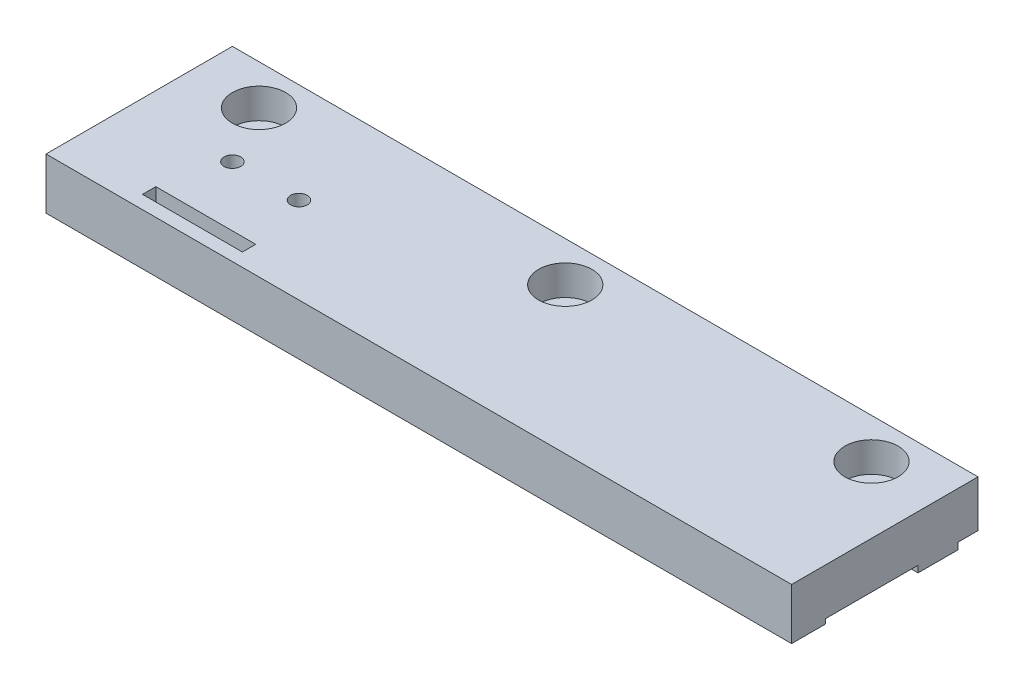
ISO-10303-21;
HEADER;
FILE_DESCRIPTION(('STEP AP214'),'2;1');
FILE_NAME('part.step','',(''),(''),'','','');
FILE_SCHEMA(('AUTOMOTIVE_DESIGN { 1 0 10303 214 1 1 1 1 }'));
ENDSEC;
DATA;
#1=APPLICATION_CONTEXT('core data for automotive mechanical design processes');
#2=APPLICATION_PROTOCOL_DEFINITION('international standard','automotive_design',2000,#1);
#3=PRODUCT_CONTEXT('',#1,'mechanical');
#4=PRODUCT('Part','Part','',(#3));
#5=PRODUCT_RELATED_PRODUCT_CATEGORY('part','',(#4));
#6=PRODUCT_DEFINITION_FORMATION('','',#4);
#7=PRODUCT_DEFINITION_CONTEXT('part definition',#1,'design');
#8=PRODUCT_DEFINITION('design','',#6,#7);
#9=PRODUCT_DEFINITION_SHAPE('','',#8);
#10=(LENGTH_UNIT() NAMED_UNIT(*) SI_UNIT(.MILLI.,.METRE.));
#11=(NAMED_UNIT(*) PLANE_ANGLE_UNIT() SI_UNIT($,.RADIAN.));
#12=(NAMED_UNIT(*) SI_UNIT($,.STERADIAN.) SOLID_ANGLE_UNIT());
#13=UNCERTAINTY_MEASURE_WITH_UNIT(LENGTH_MEASURE(1.E-05),#10,'distance_accuracy_value','');
#14=(GEOMETRIC_REPRESENTATION_CONTEXT(3) GLOBAL_UNCERTAINTY_ASSIGNED_CONTEXT((#13)) GLOBAL_UNIT_ASSIGNED_CONTEXT((#10,
#11,#12)) REPRESENTATION_CONTEXT('',''));
#15=CARTESIAN_POINT('',(0.,0.,0.));
#16=DIRECTION('',(0.,0.,1.));
#17=DIRECTION('',(1.,0.,0.));
#18=AXIS2_PLACEMENT_3D('',#15,#16,#17);
#19=CARTESIAN_POINT('',(102.,-20.,6.));
#20=DIRECTION('',(0.,1.,0.));
#21=DIRECTION('',(0.,0.,1.));
#22=AXIS2_PLACEMENT_3D('',#19,#20,#21);
#23=CYLINDRICAL_SURFACE('',#22,2.25);
#24=CARTESIAN_POINT('',(102.,0.,6.));
#25=DIRECTION('',(0.,1.,0.));
#26=DIRECTION('',(0.,0.,1.));
#27=AXIS2_PLACEMENT_3D('',#24,#25,#26);
#28=CIRCLE('',#27,2.25);
#29=CARTESIAN_POINT('',(102.,0.,8.25));
#30=VERTEX_POINT('',#29);
#31=EDGE_CURVE('E161',#30,#30,#28,.T.);
#32=ORIENTED_EDGE('',*,*,#31,.F.);
#33=EDGE_LOOP('',(#32));
#34=FACE_BOUND('',#33,.T.);
#35=CARTESIAN_POINT('',(102.,3.5,6.));
#36=DIRECTION('',(0.,1.,0.));
#37=DIRECTION('',(0.,0.,1.));
#38=AXIS2_PLACEMENT_3D('',#35,#36,#37);
#39=CIRCLE('',#38,2.25);
#40=CARTESIAN_POINT('',(102.,3.5,8.25));
#41=VERTEX_POINT('',#40);
#42=EDGE_CURVE('E37',#41,#41,#39,.F.);
#43=ORIENTED_EDGE('',*,*,#42,.F.);
#44=EDGE_LOOP('',(#43));
#45=FACE_BOUND('',#44,.T.);
#46=ADVANCED_FACE('F33',(#34,#45),#23,.F.);
#47=CARTESIAN_POINT('',(56.,-20.,6.));
#48=DIRECTION('',(0.,1.,0.));
#49=DIRECTION('',(0.,0.,1.));
#50=AXIS2_PLACEMENT_3D('',#47,#48,#49);
#51=CYLINDRICAL_SURFACE('',#50,2.25);
#52=CARTESIAN_POINT('',(56.,0.,6.));
#53=DIRECTION('',(0.,1.,0.));
#54=DIRECTION('',(0.,0.,1.));
#55=AXIS2_PLACEMENT_3D('',#52,#53,#54);
#56=CIRCLE('',#55,2.25);
#57=CARTESIAN_POINT('',(56.,0.,8.25));
#58=VERTEX_POINT('',#57);
#59=EDGE_CURVE('E166',#58,#58,#56,.T.);
#60=ORIENTED_EDGE('',*,*,#59,.F.);
#61=EDGE_LOOP('',(#60));
#62=FACE_BOUND('',#61,.T.);
#63=CARTESIAN_POINT('',(56.,3.5,6.));
#64=DIRECTION('',(0.,1.,0.));
#65=DIRECTION('',(0.,0.,1.));
#66=AXIS2_PLACEMENT_3D('',#63,#64,#65);
#67=CIRCLE('',#66,2.25);
#68=CARTESIAN_POINT('',(56.,3.5,8.25));
#69=VERTEX_POINT('',#68);
#70=EDGE_CURVE('E265',#69,#69,#67,.F.);
#71=ORIENTED_EDGE('',*,*,#70,.F.);
#72=EDGE_LOOP('',(#71));
#73=FACE_BOUND('',#72,.T.);
#74=ADVANCED_FACE('F312',(#62,#73),#51,.F.);
#75=CARTESIAN_POINT('',(10.,-20.,6.));
#76=DIRECTION('',(0.,1.,0.));
#77=DIRECTION('',(0.,0.,1.));
#78=AXIS2_PLACEMENT_3D('',#75,#76,#77);
#79=CYLINDRICAL_SURFACE('',#78,2.25);
#80=CARTESIAN_POINT('',(10.,0.,6.));
#81=DIRECTION('',(0.,1.,0.));
#82=DIRECTION('',(0.,0.,1.));
#83=AXIS2_PLACEMENT_3D('',#80,#81,#82);
#84=CIRCLE('',#83,2.25);
#85=CARTESIAN_POINT('',(10.,0.,8.25));
#86=VERTEX_POINT('',#85);
#87=EDGE_CURVE('E169',#86,#86,#84,.T.);
#88=ORIENTED_EDGE('',*,*,#87,.F.);
#89=EDGE_LOOP('',(#88));
#90=FACE_BOUND('',#89,.T.);
#91=CARTESIAN_POINT('',(10.,3.5,6.));
#92=DIRECTION('',(0.,1.,0.));
#93=DIRECTION('',(0.,0.,1.));
#94=AXIS2_PLACEMENT_3D('',#91,#92,#93);
#95=CIRCLE('',#94,2.25);
#96=CARTESIAN_POINT('',(10.,3.5,8.25));
#97=VERTEX_POINT('',#96);
#98=EDGE_CURVE('E262',#97,#97,#95,.F.);
#99=ORIENTED_EDGE('',*,*,#98,.F.);
#100=EDGE_LOOP('',(#99));
#101=FACE_BOUND('',#100,.T.);
#102=ADVANCED_FACE('F318',(#90,#101),#79,.F.);
#103=CARTESIAN_POINT('',(0.,0.,28.));
#104=DIRECTION('',(1.,0.,0.));
#105=DIRECTION('',(0.,0.,-1.));
#106=AXIS2_PLACEMENT_3D('',#103,#104,#105);
#107=PLANE('',#106);
#108=DIRECTION('',(0.,-1.,0.));
#109=VECTOR('',#108,1.);
#110=CARTESIAN_POINT('',(0.,0.,9.));
#111=LINE('',#110,#109);
#112=CARTESIAN_POINT('',(0.,1.,9.));
#113=VERTEX_POINT('',#112);
#114=CARTESIAN_POINT('',(0.,0.,9.));
#115=VERTEX_POINT('',#114);
#116=EDGE_CURVE('E188',#113,#115,#111,.T.);
#117=ORIENTED_EDGE('',*,*,#116,.F.);
#118=DIRECTION('',(0.,0.,-1.));
#119=VECTOR('',#118,1.);
#120=CARTESIAN_POINT('',(0.,1.,22.8999999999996));
#121=LINE('',#120,#119);
#122=CARTESIAN_POINT('',(0.,1.,22.8999999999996));
#123=VERTEX_POINT('',#122);
#124=EDGE_CURVE('E185',#123,#113,#121,.T.);
#125=ORIENTED_EDGE('',*,*,#124,.F.);
#126=DIRECTION('',(0.,1.,0.));
#127=VECTOR('',#126,1.);
#128=CARTESIAN_POINT('',(0.,1.,22.8999999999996));
#129=LINE('',#128,#127);
#130=CARTESIAN_POINT('',(0.,0.300000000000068,22.8999999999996));
#131=VERTEX_POINT('',#130);
#132=EDGE_CURVE('E182',#131,#123,#129,.T.);
#133=ORIENTED_EDGE('',*,*,#132,.F.);
#134=DIRECTION('',(0.,0.,-1.));
#135=VECTOR('',#134,1.);
#136=CARTESIAN_POINT('',(0.,0.299999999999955,27.9999999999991));
#137=LINE('',#136,#135);
#138=CARTESIAN_POINT('',(0.,0.299999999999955,27.9999999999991));
#139=VERTEX_POINT('',#138);
#140=EDGE_CURVE('E179',#139,#131,#137,.T.);
#141=ORIENTED_EDGE('',*,*,#140,.F.);
#142=DIRECTION('',(0.,-1.,0.));
#143=VECTOR('',#142,1.);
#144=CARTESIAN_POINT('',(0.,0.,28.));
#145=LINE('',#144,#143);
#146=CARTESIAN_POINT('',(0.,8.,28.));
#147=VERTEX_POINT('',#146);
#148=EDGE_CURVE('E225',#147,#139,#145,.T.);
#149=ORIENTED_EDGE('',*,*,#148,.F.);
#150=DIRECTION('',(0.,0.,-1.));
#151=VECTOR('',#150,1.);
#152=CARTESIAN_POINT('',(0.,8.,28.));
#153=LINE('',#152,#151);
#154=CARTESIAN_POINT('',(0.,8.,0.));
#155=VERTEX_POINT('',#154);
#156=EDGE_CURVE('E233',#147,#155,#153,.T.);
#157=ORIENTED_EDGE('',*,*,#156,.T.);
#158=DIRECTION('',(0.,-1.,0.));
#159=VECTOR('',#158,1.);
#160=CARTESIAN_POINT('',(0.,0.,0.));
#161=LINE('',#160,#159);
#162=CARTESIAN_POINT('',(0.,1.,0.));
#163=VERTEX_POINT('',#162);
#164=EDGE_CURVE('E209',#155,#163,#161,.T.);
#165=ORIENTED_EDGE('',*,*,#164,.T.);
#166=DIRECTION('',(0.,0.,-1.));
#167=VECTOR('',#166,1.);
#168=CARTESIAN_POINT('',(0.,1.,3.));
#169=LINE('',#168,#167);
#170=CARTESIAN_POINT('',(0.,1.,3.));
#171=VERTEX_POINT('',#170);
#172=EDGE_CURVE('E176',#171,#163,#169,.T.);
#173=ORIENTED_EDGE('',*,*,#172,.F.);
#174=DIRECTION('',(0.,1.,0.));
#175=VECTOR('',#174,1.);
#176=CARTESIAN_POINT('',(0.,0.,3.));
#177=LINE('',#176,#175);
#178=CARTESIAN_POINT('',(0.,0.,3.));
#179=VERTEX_POINT('',#178);
#180=EDGE_CURVE('E173',#179,#171,#177,.T.);
#181=ORIENTED_EDGE('',*,*,#180,.F.);
#182=DIRECTION('',(0.,0.,-1.));
#183=VECTOR('',#182,1.);
#184=CARTESIAN_POINT('',(0.,0.,28.));
#185=LINE('',#184,#183);
#186=EDGE_CURVE('E247',#115,#179,#185,.T.);
#187=ORIENTED_EDGE('',*,*,#186,.F.);
#188=EDGE_LOOP('',(#117,#125,#133,#141,#149,#157,#165,#173,#181,#187));
#189=FACE_BOUND('',#188,.T.);
#190=ADVANCED_FACE('F35',(#189),#107,.F.);
#191=CARTESIAN_POINT('',(0.,0.,28.));
#192=DIRECTION('',(0.,1.,0.));
#193=DIRECTION('',(0.,0.,1.));
#194=AXIS2_PLACEMENT_3D('',#191,#192,#193);
#195=PLANE('',#194);
#196=ORIENTED_EDGE('',*,*,#31,.T.);
#197=EDGE_LOOP('',(#196));
#198=FACE_BOUND('',#197,.T.);
#199=ORIENTED_EDGE('',*,*,#59,.T.);
#200=EDGE_LOOP('',(#199));
#201=FACE_BOUND('',#200,.T.);
#202=ORIENTED_EDGE('',*,*,#87,.T.);
#203=EDGE_LOOP('',(#202));
#204=FACE_BOUND('',#203,.T.);
#205=DIRECTION('',(1.,0.,0.));
#206=VECTOR('',#205,1.);
#207=CARTESIAN_POINT('',(0.,0.,9.));
#208=LINE('',#207,#206);
#209=CARTESIAN_POINT('',(112.,0.,9.));
#210=VERTEX_POINT('',#209);
#211=EDGE_CURVE('E207',#115,#210,#208,.T.);
#212=ORIENTED_EDGE('',*,*,#211,.F.);
#213=ORIENTED_EDGE('',*,*,#186,.T.);
#214=DIRECTION('',(1.,0.,0.));
#215=VECTOR('',#214,1.);
#216=CARTESIAN_POINT('',(0.,0.,3.));
#217=LINE('',#216,#215);
#218=CARTESIAN_POINT('',(112.,0.,3.));
#219=VERTEX_POINT('',#218);
#220=EDGE_CURVE('E190',#179,#219,#217,.T.);
#221=ORIENTED_EDGE('',*,*,#220,.T.);
#222=DIRECTION('',(0.,0.,-1.));
#223=VECTOR('',#222,1.);
#224=CARTESIAN_POINT('',(112.,0.,28.));
#225=LINE('',#224,#223);
#226=EDGE_CURVE('E244',#210,#219,#225,.T.);
#227=ORIENTED_EDGE('',*,*,#226,.F.);
#228=EDGE_LOOP('',(#212,#213,#221,#227));
#229=FACE_BOUND('',#228,.T.);
#230=ADVANCED_FACE('F355',(#198,#201,#204,#229),#195,.F.);
#231=CARTESIAN_POINT('',(112.,0.,28.));
#232=DIRECTION('',(-1.,0.,0.));
#233=DIRECTION('',(0.,0.,1.));
#234=AXIS2_PLACEMENT_3D('',#231,#232,#233);
#235=PLANE('',#234);
#236=DIRECTION('',(0.,-1.,0.));
#237=VECTOR('',#236,1.);
#238=CARTESIAN_POINT('',(112.,0.,9.));
#239=LINE('',#238,#237);
#240=CARTESIAN_POINT('',(112.,1.,9.));
#241=VERTEX_POINT('',#240);
#242=EDGE_CURVE('E177',#241,#210,#239,.T.);
#243=ORIENTED_EDGE('',*,*,#242,.T.);
#244=ORIENTED_EDGE('',*,*,#226,.T.);
#245=DIRECTION('',(0.,1.,0.));
#246=VECTOR('',#245,1.);
#247=CARTESIAN_POINT('',(112.,0.,3.));
#248=LINE('',#247,#246);
#249=CARTESIAN_POINT('',(112.,1.,3.));
#250=VERTEX_POINT('',#249);
#251=EDGE_CURVE('E172',#219,#250,#248,.T.);
#252=ORIENTED_EDGE('',*,*,#251,.T.);
#253=DIRECTION('',(0.,0.,-1.));
#254=VECTOR('',#253,1.);
#255=CARTESIAN_POINT('',(112.,1.,3.));
#256=LINE('',#255,#254);
#257=CARTESIAN_POINT('',(112.,1.,0.));
#258=VERTEX_POINT('',#257);
#259=EDGE_CURVE('E193',#250,#258,#256,.T.);
#260=ORIENTED_EDGE('',*,*,#259,.T.);
#261=DIRECTION('',(0.,1.,0.));
#262=VECTOR('',#261,1.);
#263=CARTESIAN_POINT('',(112.,0.,0.));
#264=LINE('',#263,#262);
#265=CARTESIAN_POINT('',(112.,8.,0.));
#266=VERTEX_POINT('',#265);
#267=EDGE_CURVE('E236',#258,#266,#264,.T.);
#268=ORIENTED_EDGE('',*,*,#267,.T.);
#269=DIRECTION('',(0.,0.,-1.));
#270=VECTOR('',#269,1.);
#271=CARTESIAN_POINT('',(112.,8.,28.));
#272=LINE('',#271,#270);
#273=CARTESIAN_POINT('',(112.,8.,28.));
#274=VERTEX_POINT('',#273);
#275=EDGE_CURVE('E241',#274,#266,#272,.T.);
#276=ORIENTED_EDGE('',*,*,#275,.F.);
#277=DIRECTION('',(0.,1.,0.));
#278=VECTOR('',#277,1.);
#279=CARTESIAN_POINT('',(112.,0.,28.));
#280=LINE('',#279,#278);
#281=CARTESIAN_POINT('',(112.,0.299999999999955,28.));
#282=VERTEX_POINT('',#281);
#283=EDGE_CURVE('E228',#282,#274,#280,.T.);
#284=ORIENTED_EDGE('',*,*,#283,.F.);
#285=DIRECTION('',(0.,0.,-1.));
#286=VECTOR('',#285,1.);
#287=CARTESIAN_POINT('',(112.,0.299999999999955,27.9999999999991));
#288=LINE('',#287,#286);
#289=CARTESIAN_POINT('',(112.,0.300000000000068,22.8999999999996));
#290=VERTEX_POINT('',#289);
#291=EDGE_CURVE('E196',#282,#290,#288,.T.);
#292=ORIENTED_EDGE('',*,*,#291,.T.);
#293=DIRECTION('',(0.,1.,0.));
#294=VECTOR('',#293,1.);
#295=CARTESIAN_POINT('',(112.,1.,22.8999999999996));
#296=LINE('',#295,#294);
#297=CARTESIAN_POINT('',(112.,1.,22.8999999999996));
#298=VERTEX_POINT('',#297);
#299=EDGE_CURVE('E199',#290,#298,#296,.T.);
#300=ORIENTED_EDGE('',*,*,#299,.T.);
#301=DIRECTION('',(0.,0.,-1.));
#302=VECTOR('',#301,1.);
#303=CARTESIAN_POINT('',(112.,1.,22.8999999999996));
#304=LINE('',#303,#302);
#305=EDGE_CURVE('E202',#298,#241,#304,.T.);
#306=ORIENTED_EDGE('',*,*,#305,.T.);
#307=EDGE_LOOP('',(#243,#244,#252,#260,#268,#276,#284,#292,#300,#306));
#308=FACE_BOUND('',#307,.T.);
#309=ADVANCED_FACE('F350',(#308),#235,.F.);
#310=CARTESIAN_POINT('',(0.,8.,28.));
#311=DIRECTION('',(0.,0.,-1.));
#312=DIRECTION('',(-1.,0.,0.));
#313=AXIS2_PLACEMENT_3D('',#310,#311,#312);
#314=PLANE('',#313);
#315=DIRECTION('',(1.,0.,0.));
#316=VECTOR('',#315,1.);
#317=CARTESIAN_POINT('',(0.,0.299999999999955,27.9999999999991));
#318=LINE('',#317,#316);
#319=EDGE_CURVE('E216',#139,#282,#318,.T.);
#320=ORIENTED_EDGE('',*,*,#319,.T.);
#321=ORIENTED_EDGE('',*,*,#283,.T.);
#322=DIRECTION('',(-1.,0.,0.));
#323=VECTOR('',#322,1.);
#324=CARTESIAN_POINT('',(0.,8.,28.));
#325=LINE('',#324,#323);
#326=EDGE_CURVE('E231',#274,#147,#325,.T.);
#327=ORIENTED_EDGE('',*,*,#326,.T.);
#328=ORIENTED_EDGE('',*,*,#148,.T.);
#329=EDGE_LOOP('',(#320,#321,#327,#328));
#330=FACE_BOUND('',#329,.T.);
#331=ADVANCED_FACE('F305',(#330),#314,.F.);
#332=CARTESIAN_POINT('',(0.,8.,0.));
#333=DIRECTION('',(0.,0.,-1.));
#334=DIRECTION('',(-1.,0.,0.));
#335=AXIS2_PLACEMENT_3D('',#332,#333,#334);
#336=PLANE('',#335);
#337=ORIENTED_EDGE('',*,*,#267,.F.);
#338=DIRECTION('',(1.,0.,0.));
#339=VECTOR('',#338,1.);
#340=CARTESIAN_POINT('',(0.,1.,0.));
#341=LINE('',#340,#339);
#342=EDGE_CURVE('E219',#163,#258,#341,.T.);
#343=ORIENTED_EDGE('',*,*,#342,.F.);
#344=ORIENTED_EDGE('',*,*,#164,.F.);
#345=DIRECTION('',(-1.,0.,0.));
#346=VECTOR('',#345,1.);
#347=CARTESIAN_POINT('',(0.,8.,0.));
#348=LINE('',#347,#346);
#349=EDGE_CURVE('E229',#266,#155,#348,.T.);
#350=ORIENTED_EDGE('',*,*,#349,.F.);
#351=EDGE_LOOP('',(#337,#343,#344,#350));
#352=FACE_BOUND('',#351,.T.);
#353=ADVANCED_FACE('F295',(#352),#336,.T.);
#354=CARTESIAN_POINT('',(0.,8.,28.));
#355=DIRECTION('',(0.,-1.,0.));
#356=DIRECTION('',(0.,0.,-1.));
#357=AXIS2_PLACEMENT_3D('',#354,#355,#356);
#358=PLANE('',#357);
#359=CARTESIAN_POINT('',(102.,8.,6.));
#360=DIRECTION('',(0.,1.,0.));
#361=DIRECTION('',(0.,0.,1.));
#362=AXIS2_PLACEMENT_3D('',#359,#360,#361);
#363=CIRCLE('',#362,4.);
#364=CARTESIAN_POINT('',(102.,8.,10.));
#365=VERTEX_POINT('',#364);
#366=EDGE_CURVE('E281',#365,#365,#363,.T.);
#367=ORIENTED_EDGE('',*,*,#366,.F.);
#368=EDGE_LOOP('',(#367));
#369=FACE_BOUND('',#368,.T.);
#370=CARTESIAN_POINT('',(56.,8.,6.));
#371=DIRECTION('',(0.,1.,0.));
#372=DIRECTION('',(0.,0.,1.));
#373=AXIS2_PLACEMENT_3D('',#370,#371,#372);
#374=CIRCLE('',#373,4.);
#375=CARTESIAN_POINT('',(56.,8.,10.));
#376=VERTEX_POINT('',#375);
#377=EDGE_CURVE('E274',#376,#376,#374,.T.);
#378=ORIENTED_EDGE('',*,*,#377,.F.);
#379=EDGE_LOOP('',(#378));
#380=FACE_BOUND('',#379,.T.);
#381=CARTESIAN_POINT('',(10.,8.,6.));
#382=DIRECTION('',(0.,1.,0.));
#383=DIRECTION('',(0.,0.,1.));
#384=AXIS2_PLACEMENT_3D('',#381,#382,#383);
#385=CIRCLE('',#384,4.);
#386=CARTESIAN_POINT('',(10.,8.,10.));
#387=VERTEX_POINT('',#386);
#388=EDGE_CURVE('E267',#387,#387,#385,.T.);
#389=ORIENTED_EDGE('',*,*,#388,.F.);
#390=EDGE_LOOP('',(#389));
#391=FACE_BOUND('',#390,.T.);
#392=CARTESIAN_POINT('',(25.0000000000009,8.,15.));
#393=DIRECTION('',(0.,1.,0.));
#394=DIRECTION('',(0.,0.,1.));
#395=AXIS2_PLACEMENT_3D('',#392,#393,#394);
#396=CIRCLE('',#395,1.25);
#397=CARTESIAN_POINT('',(25.0000000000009,8.,16.25));
#398=VERTEX_POINT('',#397);
#399=EDGE_CURVE('E261',#398,#398,#396,.T.);
#400=ORIENTED_EDGE('',*,*,#399,.F.);
#401=EDGE_LOOP('',(#400));
#402=FACE_BOUND('',#401,.T.);
#403=CARTESIAN_POINT('',(15.,8.,15.));
#404=DIRECTION('',(0.,1.,0.));
#405=DIRECTION('',(0.,0.,1.));
#406=AXIS2_PLACEMENT_3D('',#403,#404,#405);
#407=CIRCLE('',#406,1.25);
#408=CARTESIAN_POINT('',(15.,8.,16.25));
#409=VERTEX_POINT('',#408);
#410=EDGE_CURVE('E257',#409,#409,#407,.T.);
#411=ORIENTED_EDGE('',*,*,#410,.F.);
#412=EDGE_LOOP('',(#411));
#413=FACE_BOUND('',#412,.T.);
#414=DIRECTION('',(1.,0.,0.));
#415=VECTOR('',#414,1.);
#416=CARTESIAN_POINT('',(12.5,8.,26.));
#417=LINE('',#416,#415);
#418=CARTESIAN_POINT('',(12.5,8.,26.));
#419=VERTEX_POINT('',#418);
#420=CARTESIAN_POINT('',(27.5,8.,26.));
#421=VERTEX_POINT('',#420);
#422=EDGE_CURVE('E147',#419,#421,#417,.T.);
#423=ORIENTED_EDGE('',*,*,#422,.F.);
#424=DIRECTION('',(0.,0.,1.));
#425=VECTOR('',#424,1.);
#426=CARTESIAN_POINT('',(12.5,8.,26.));
#427=LINE('',#426,#425);
#428=CARTESIAN_POINT('',(12.5,8.,24.));
#429=VERTEX_POINT('',#428);
#430=EDGE_CURVE('E50',#429,#419,#427,.T.);
#431=ORIENTED_EDGE('',*,*,#430,.F.);
#432=DIRECTION('',(-1.,0.,0.));
#433=VECTOR('',#432,1.);
#434=CARTESIAN_POINT('',(12.5,8.,24.));
#435=LINE('',#434,#433);
#436=CARTESIAN_POINT('',(27.5,8.,24.));
#437=VERTEX_POINT('',#436);
#438=EDGE_CURVE('E154',#437,#429,#435,.T.);
#439=ORIENTED_EDGE('',*,*,#438,.F.);
#440=DIRECTION('',(0.,0.,-1.));
#441=VECTOR('',#440,1.);
#442=CARTESIAN_POINT('',(27.5,8.,26.));
#443=LINE('',#442,#441);
#444=EDGE_CURVE('E138',#421,#437,#443,.T.);
#445=ORIENTED_EDGE('',*,*,#444,.F.);
#446=EDGE_LOOP('',(#423,#431,#439,#445));
#447=FACE_BOUND('',#446,.T.);
#448=ORIENTED_EDGE('',*,*,#349,.T.);
#449=ORIENTED_EDGE('',*,*,#156,.F.);
#450=ORIENTED_EDGE('',*,*,#326,.F.);
#451=ORIENTED_EDGE('',*,*,#275,.T.);
#452=EDGE_LOOP('',(#448,#449,#450,#451));
#453=FACE_BOUND('',#452,.T.);
#454=ADVANCED_FACE('F151',(#369,#380,#391,#402,#413,#447,#453),#358,.F.);
#455=CARTESIAN_POINT('',(0.,1.,3.));
#456=DIRECTION('',(0.,-1.,0.));
#457=DIRECTION('',(0.,0.,-1.));
#458=AXIS2_PLACEMENT_3D('',#455,#456,#457);
#459=PLANE('',#458);
#460=ORIENTED_EDGE('',*,*,#259,.F.);
#461=DIRECTION('',(1.,0.,0.));
#462=VECTOR('',#461,1.);
#463=CARTESIAN_POINT('',(0.,1.,3.));
#464=LINE('',#463,#462);
#465=EDGE_CURVE('E221',#171,#250,#464,.T.);
#466=ORIENTED_EDGE('',*,*,#465,.F.);
#467=ORIENTED_EDGE('',*,*,#172,.T.);
#468=ORIENTED_EDGE('',*,*,#342,.T.);
#469=EDGE_LOOP('',(#460,#466,#467,#468));
#470=FACE_BOUND('',#469,.T.);
#471=ADVANCED_FACE('F294',(#470),#459,.T.);
#472=CARTESIAN_POINT('',(0.,0.,3.));
#473=DIRECTION('',(0.,0.,-1.));
#474=DIRECTION('',(-1.,0.,0.));
#475=AXIS2_PLACEMENT_3D('',#472,#473,#474);
#476=PLANE('',#475);
#477=ORIENTED_EDGE('',*,*,#251,.F.);
#478=ORIENTED_EDGE('',*,*,#220,.F.);
#479=ORIENTED_EDGE('',*,*,#180,.T.);
#480=ORIENTED_EDGE('',*,*,#465,.T.);
#481=EDGE_LOOP('',(#477,#478,#479,#480));
#482=FACE_BOUND('',#481,.T.);
#483=ADVANCED_FACE('F302',(#482),#476,.T.);
#484=CARTESIAN_POINT('',(0.,0.,9.));
#485=DIRECTION('',(0.,0.,1.));
#486=DIRECTION('',(1.,0.,0.));
#487=AXIS2_PLACEMENT_3D('',#484,#485,#486);
#488=PLANE('',#487);
#489=ORIENTED_EDGE('',*,*,#242,.F.);
#490=DIRECTION('',(1.,0.,0.));
#491=VECTOR('',#490,1.);
#492=CARTESIAN_POINT('',(0.,1.,9.));
#493=LINE('',#492,#491);
#494=EDGE_CURVE('E210',#113,#241,#493,.T.);
#495=ORIENTED_EDGE('',*,*,#494,.F.);
#496=ORIENTED_EDGE('',*,*,#116,.T.);
#497=ORIENTED_EDGE('',*,*,#211,.T.);
#498=EDGE_LOOP('',(#489,#495,#496,#497));
#499=FACE_BOUND('',#498,.T.);
#500=ADVANCED_FACE('F330',(#499),#488,.T.);
#501=CARTESIAN_POINT('',(0.,1.,22.8999999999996));
#502=DIRECTION('',(0.,-1.,0.));
#503=DIRECTION('',(0.,0.,-1.));
#504=AXIS2_PLACEMENT_3D('',#501,#502,#503);
#505=PLANE('',#504);
#506=CARTESIAN_POINT('',(25.0000000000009,1.,15.));
#507=DIRECTION('',(0.,-1.,0.));
#508=DIRECTION('',(0.,0.,-1.));
#509=AXIS2_PLACEMENT_3D('',#506,#507,#508);
#510=CIRCLE('',#509,1.25);
#511=CARTESIAN_POINT('',(25.0000000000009,1.,13.75));
#512=VERTEX_POINT('',#511);
#513=EDGE_CURVE('E258',#512,#512,#510,.T.);
#514=ORIENTED_EDGE('',*,*,#513,.F.);
#515=EDGE_LOOP('',(#514));
#516=FACE_BOUND('',#515,.T.);
#517=CARTESIAN_POINT('',(15.,1.,15.));
#518=DIRECTION('',(0.,-1.,0.));
#519=DIRECTION('',(0.,0.,-1.));
#520=AXIS2_PLACEMENT_3D('',#517,#518,#519);
#521=CIRCLE('',#520,1.25);
#522=CARTESIAN_POINT('',(15.,1.,13.75));
#523=VERTEX_POINT('',#522);
#524=EDGE_CURVE('E254',#523,#523,#521,.T.);
#525=ORIENTED_EDGE('',*,*,#524,.F.);
#526=EDGE_LOOP('',(#525));
#527=FACE_BOUND('',#526,.T.);
#528=ORIENTED_EDGE('',*,*,#305,.F.);
#529=DIRECTION('',(1.,0.,0.));
#530=VECTOR('',#529,1.);
#531=CARTESIAN_POINT('',(0.,1.,22.8999999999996));
#532=LINE('',#531,#530);
#533=EDGE_CURVE('E212',#123,#298,#532,.T.);
#534=ORIENTED_EDGE('',*,*,#533,.F.);
#535=ORIENTED_EDGE('',*,*,#124,.T.);
#536=ORIENTED_EDGE('',*,*,#494,.T.);
#537=EDGE_LOOP('',(#528,#534,#535,#536));
#538=FACE_BOUND('',#537,.T.);
#539=ADVANCED_FACE('F333',(#516,#527,#538),#505,.T.);
#540=CARTESIAN_POINT('',(0.,1.,22.8999999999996));
#541=DIRECTION('',(0.,0.,-1.));
#542=DIRECTION('',(-1.,0.,0.));
#543=AXIS2_PLACEMENT_3D('',#540,#541,#542);
#544=PLANE('',#543);
#545=ORIENTED_EDGE('',*,*,#299,.F.);
#546=DIRECTION('',(1.,0.,0.));
#547=VECTOR('',#546,1.);
#548=CARTESIAN_POINT('',(0.,0.300000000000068,22.8999999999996));
#549=LINE('',#548,#547);
#550=EDGE_CURVE('E214',#131,#290,#549,.T.);
#551=ORIENTED_EDGE('',*,*,#550,.F.);
#552=ORIENTED_EDGE('',*,*,#132,.T.);
#553=ORIENTED_EDGE('',*,*,#533,.T.);
#554=EDGE_LOOP('',(#545,#551,#552,#553));
#555=FACE_BOUND('',#554,.T.);
#556=ADVANCED_FACE('F337',(#555),#544,.T.);
#557=CARTESIAN_POINT('',(0.,0.299999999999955,27.9999999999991));
#558=DIRECTION('',(0.,-1.,0.));
#559=DIRECTION('',(0.,0.,-1.));
#560=AXIS2_PLACEMENT_3D('',#557,#558,#559);
#561=PLANE('',#560);
#562=DIRECTION('',(0.,0.,-1.));
#563=VECTOR('',#562,1.);
#564=CARTESIAN_POINT('',(12.5,0.299999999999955,27.9999999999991));
#565=LINE('',#564,#563);
#566=CARTESIAN_POINT('',(12.5,0.299999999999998,26.));
#567=VERTEX_POINT('',#566);
#568=CARTESIAN_POINT('',(12.5,0.300000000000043,24.));
#569=VERTEX_POINT('',#568);
#570=EDGE_CURVE('E12',#567,#569,#565,.T.);
#571=ORIENTED_EDGE('',*,*,#570,.F.);
#572=DIRECTION('',(-1.,0.,0.));
#573=VECTOR('',#572,1.);
#574=CARTESIAN_POINT('',(0.,0.299999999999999,26.));
#575=LINE('',#574,#573);
#576=CARTESIAN_POINT('',(27.5,0.299999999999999,26.));
#577=VERTEX_POINT('',#576);
#578=EDGE_CURVE('E250',#577,#567,#575,.T.);
#579=ORIENTED_EDGE('',*,*,#578,.F.);
#580=DIRECTION('',(0.,0.,1.));
#581=VECTOR('',#580,1.);
#582=CARTESIAN_POINT('',(27.5,0.299999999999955,27.9999999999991));
#583=LINE('',#582,#581);
#584=CARTESIAN_POINT('',(27.5,0.300000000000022,24.));
#585=VERTEX_POINT('',#584);
#586=EDGE_CURVE('E141',#585,#577,#583,.T.);
#587=ORIENTED_EDGE('',*,*,#586,.F.);
#588=DIRECTION('',(1.,0.,0.));
#589=VECTOR('',#588,1.);
#590=CARTESIAN_POINT('',(0.,0.300000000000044,24.));
#591=LINE('',#590,#589);
#592=EDGE_CURVE('E42',#569,#585,#591,.T.);
#593=ORIENTED_EDGE('',*,*,#592,.F.);
#594=EDGE_LOOP('',(#571,#579,#587,#593));
#595=FACE_BOUND('',#594,.T.);
#596=ORIENTED_EDGE('',*,*,#291,.F.);
#597=ORIENTED_EDGE('',*,*,#319,.F.);
#598=ORIENTED_EDGE('',*,*,#140,.T.);
#599=ORIENTED_EDGE('',*,*,#550,.T.);
#600=EDGE_LOOP('',(#596,#597,#598,#599));
#601=FACE_BOUND('',#600,.T.);
#602=ADVANCED_FACE('F341',(#595,#601),#561,.T.);
#603=CARTESIAN_POINT('',(12.5,-20.,26.));
#604=DIRECTION('',(-1.,0.,0.));
#605=DIRECTION('',(0.,0.,1.));
#606=AXIS2_PLACEMENT_3D('',#603,#604,#605);
#607=PLANE('',#606);
#608=ORIENTED_EDGE('',*,*,#570,.T.);
#609=DIRECTION('',(0.,1.,0.));
#610=VECTOR('',#609,1.);
#611=CARTESIAN_POINT('',(12.5,-20.,24.));
#612=LINE('',#611,#610);
#613=EDGE_CURVE('E159',#569,#429,#612,.T.);
#614=ORIENTED_EDGE('',*,*,#613,.T.);
#615=ORIENTED_EDGE('',*,*,#430,.T.);
#616=DIRECTION('',(0.,1.,0.));
#617=VECTOR('',#616,1.);
#618=CARTESIAN_POINT('',(12.5,-20.,26.));
#619=LINE('',#618,#617);
#620=EDGE_CURVE('E144',#567,#419,#619,.T.);
#621=ORIENTED_EDGE('',*,*,#620,.F.);
#622=EDGE_LOOP('',(#608,#614,#615,#621));
#623=FACE_BOUND('',#622,.T.);
#624=ADVANCED_FACE('F324',(#623),#607,.F.);
#625=CARTESIAN_POINT('',(12.5,-20.,24.));
#626=DIRECTION('',(0.,0.,-1.));
#627=DIRECTION('',(-1.,0.,0.));
#628=AXIS2_PLACEMENT_3D('',#625,#626,#627);
#629=PLANE('',#628);
#630=ORIENTED_EDGE('',*,*,#592,.T.);
#631=DIRECTION('',(0.,1.,0.));
#632=VECTOR('',#631,1.);
#633=CARTESIAN_POINT('',(27.5,-20.,24.));
#634=LINE('',#633,#632);
#635=EDGE_CURVE('E143',#585,#437,#634,.T.);
#636=ORIENTED_EDGE('',*,*,#635,.T.);
#637=ORIENTED_EDGE('',*,*,#438,.T.);
#638=ORIENTED_EDGE('',*,*,#613,.F.);
#639=EDGE_LOOP('',(#630,#636,#637,#638));
#640=FACE_BOUND('',#639,.T.);
#641=ADVANCED_FACE('F417',(#640),#629,.F.);
#642=CARTESIAN_POINT('',(27.5,-20.,26.));
#643=DIRECTION('',(1.,0.,0.));
#644=DIRECTION('',(0.,0.,-1.));
#645=AXIS2_PLACEMENT_3D('',#642,#643,#644);
#646=PLANE('',#645);
#647=ORIENTED_EDGE('',*,*,#586,.T.);
#648=DIRECTION('',(0.,1.,0.));
#649=VECTOR('',#648,1.);
#650=CARTESIAN_POINT('',(27.5,-20.,26.));
#651=LINE('',#650,#649);
#652=EDGE_CURVE('E58',#577,#421,#651,.T.);
#653=ORIENTED_EDGE('',*,*,#652,.T.);
#654=ORIENTED_EDGE('',*,*,#444,.T.);
#655=ORIENTED_EDGE('',*,*,#635,.F.);
#656=EDGE_LOOP('',(#647,#653,#654,#655));
#657=FACE_BOUND('',#656,.T.);
#658=ADVANCED_FACE('F135',(#657),#646,.F.);
#659=CARTESIAN_POINT('',(12.5,-20.,26.));
#660=DIRECTION('',(0.,0.,1.));
#661=DIRECTION('',(1.,0.,0.));
#662=AXIS2_PLACEMENT_3D('',#659,#660,#661);
#663=PLANE('',#662);
#664=ORIENTED_EDGE('',*,*,#578,.T.);
#665=ORIENTED_EDGE('',*,*,#620,.T.);
#666=ORIENTED_EDGE('',*,*,#422,.T.);
#667=ORIENTED_EDGE('',*,*,#652,.F.);
#668=EDGE_LOOP('',(#664,#665,#666,#667));
#669=FACE_BOUND('',#668,.T.);
#670=ADVANCED_FACE('F148',(#669),#663,.F.);
#671=CARTESIAN_POINT('',(15.,-20.,15.));
#672=DIRECTION('',(0.,1.,0.));
#673=DIRECTION('',(0.,0.,1.));
#674=AXIS2_PLACEMENT_3D('',#671,#672,#673);
#675=CYLINDRICAL_SURFACE('',#674,1.25);
#676=ORIENTED_EDGE('',*,*,#524,.T.);
#677=EDGE_LOOP('',(#676));
#678=FACE_BOUND('',#677,.T.);
#679=ORIENTED_EDGE('',*,*,#410,.T.);
#680=EDGE_LOOP('',(#679));
#681=FACE_BOUND('',#680,.T.);
#682=ADVANCED_FACE('F291',(#678,#681),#675,.F.);
#683=CARTESIAN_POINT('',(25.0000000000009,-20.,15.));
#684=DIRECTION('',(0.,1.,0.));
#685=DIRECTION('',(0.,0.,1.));
#686=AXIS2_PLACEMENT_3D('',#683,#684,#685);
#687=CYLINDRICAL_SURFACE('',#686,1.25);
#688=ORIENTED_EDGE('',*,*,#513,.T.);
#689=EDGE_LOOP('',(#688));
#690=FACE_BOUND('',#689,.T.);
#691=ORIENTED_EDGE('',*,*,#399,.T.);
#692=EDGE_LOOP('',(#691));
#693=FACE_BOUND('',#692,.T.);
#694=ADVANCED_FACE('F398',(#690,#693),#687,.F.);
#695=CARTESIAN_POINT('',(10.,3.5,6.));
#696=DIRECTION('',(0.,1.,0.));
#697=DIRECTION('',(0.,0.,1.));
#698=AXIS2_PLACEMENT_3D('',#695,#696,#697);
#699=PLANE('',#698);
#700=CARTESIAN_POINT('',(10.,3.5,6.));
#701=DIRECTION('',(0.,1.,0.));
#702=DIRECTION('',(0.,0.,1.));
#703=AXIS2_PLACEMENT_3D('',#700,#701,#702);
#704=CIRCLE('',#703,4.);
#705=CARTESIAN_POINT('',(10.,3.5,10.));
#706=VERTEX_POINT('',#705);
#707=EDGE_CURVE('E264',#706,#706,#704,.T.);
#708=ORIENTED_EDGE('',*,*,#707,.T.);
#709=EDGE_LOOP('',(#708));
#710=FACE_BOUND('',#709,.T.);
#711=ORIENTED_EDGE('',*,*,#98,.T.);
#712=EDGE_LOOP('',(#711));
#713=FACE_BOUND('',#712,.T.);
#714=ADVANCED_FACE('F395',(#710,#713),#699,.T.);
#715=CARTESIAN_POINT('',(10.,3.5,6.));
#716=DIRECTION('',(0.,1.,0.));
#717=DIRECTION('',(0.,0.,1.));
#718=AXIS2_PLACEMENT_3D('',#715,#716,#717);
#719=CYLINDRICAL_SURFACE('',#718,4.);
#720=ORIENTED_EDGE('',*,*,#707,.F.);
#721=EDGE_LOOP('',(#720));
#722=FACE_BOUND('',#721,.T.);
#723=ORIENTED_EDGE('',*,*,#388,.T.);
#724=EDGE_LOOP('',(#723));
#725=FACE_BOUND('',#724,.T.);
#726=ADVANCED_FACE('F397',(#722,#725),#719,.F.);
#727=CARTESIAN_POINT('',(56.,3.5,6.));
#728=DIRECTION('',(0.,1.,0.));
#729=DIRECTION('',(0.,0.,1.));
#730=AXIS2_PLACEMENT_3D('',#727,#728,#729);
#731=PLANE('',#730);
#732=CARTESIAN_POINT('',(56.,3.5,6.));
#733=DIRECTION('',(0.,1.,0.));
#734=DIRECTION('',(0.,0.,1.));
#735=AXIS2_PLACEMENT_3D('',#732,#733,#734);
#736=CIRCLE('',#735,4.);
#737=CARTESIAN_POINT('',(56.,3.5,10.));
#738=VERTEX_POINT('',#737);
#739=EDGE_CURVE('E268',#738,#738,#736,.T.);
#740=ORIENTED_EDGE('',*,*,#739,.T.);
#741=EDGE_LOOP('',(#740));
#742=FACE_BOUND('',#741,.T.);
#743=ORIENTED_EDGE('',*,*,#70,.T.);
#744=EDGE_LOOP('',(#743));
#745=FACE_BOUND('',#744,.T.);
#746=ADVANCED_FACE('F405',(#742,#745),#731,.T.);
#747=CARTESIAN_POINT('',(56.,3.5,6.));
#748=DIRECTION('',(0.,1.,0.));
#749=DIRECTION('',(0.,0.,1.));
#750=AXIS2_PLACEMENT_3D('',#747,#748,#749);
#751=CYLINDRICAL_SURFACE('',#750,4.);
#752=ORIENTED_EDGE('',*,*,#739,.F.);
#753=EDGE_LOOP('',(#752));
#754=FACE_BOUND('',#753,.T.);
#755=ORIENTED_EDGE('',*,*,#377,.T.);
#756=EDGE_LOOP('',(#755));
#757=FACE_BOUND('',#756,.T.);
#758=ADVANCED_FACE('F411',(#754,#757),#751,.F.);
#759=CARTESIAN_POINT('',(102.,3.5,6.));
#760=DIRECTION('',(0.,1.,0.));
#761=DIRECTION('',(0.,0.,1.));
#762=AXIS2_PLACEMENT_3D('',#759,#760,#761);
#763=PLANE('',#762);
#764=CARTESIAN_POINT('',(102.,3.5,6.));
#765=DIRECTION('',(0.,1.,0.));
#766=DIRECTION('',(0.,0.,1.));
#767=AXIS2_PLACEMENT_3D('',#764,#765,#766);
#768=CIRCLE('',#767,4.);
#769=CARTESIAN_POINT('',(102.,3.5,10.));
#770=VERTEX_POINT('',#769);
#771=EDGE_CURVE('E508',#770,#770,#768,.T.);
#772=ORIENTED_EDGE('',*,*,#771,.T.);
#773=EDGE_LOOP('',(#772));
#774=FACE_BOUND('',#773,.T.);
#775=ORIENTED_EDGE('',*,*,#42,.T.);
#776=EDGE_LOOP('',(#775));
#777=FACE_BOUND('',#776,.T.);
#778=ADVANCED_FACE('F482',(#774,#777),#763,.T.);
#779=CARTESIAN_POINT('',(102.,3.5,6.));
#780=DIRECTION('',(0.,1.,0.));
#781=DIRECTION('',(0.,0.,1.));
#782=AXIS2_PLACEMENT_3D('',#779,#780,#781);
#783=CYLINDRICAL_SURFACE('',#782,4.);
#784=ORIENTED_EDGE('',*,*,#771,.F.);
#785=EDGE_LOOP('',(#784));
#786=FACE_BOUND('',#785,.T.);
#787=ORIENTED_EDGE('',*,*,#366,.T.);
#788=EDGE_LOOP('',(#787));
#789=FACE_BOUND('',#788,.T.);
#790=ADVANCED_FACE('F491',(#786,#789),#783,.F.);
#791=CLOSED_SHELL('',(#46,#74,#102,#190,#230,#309,#331,#353,#454,#471,#483,#500,#539,#556,#602,
#624,#641,#658,#670,#682,#694,#714,#726,#746,#758,#778,#790));
#792=MANIFOLD_SOLID_BREP('B2',#791);
#793=ADVANCED_BREP_SHAPE_REPRESENTATION('',(#18,#792),#14);
#794=SHAPE_DEFINITION_REPRESENTATION(#9,#793);
ENDSEC;
END-ISO-10303-21;
